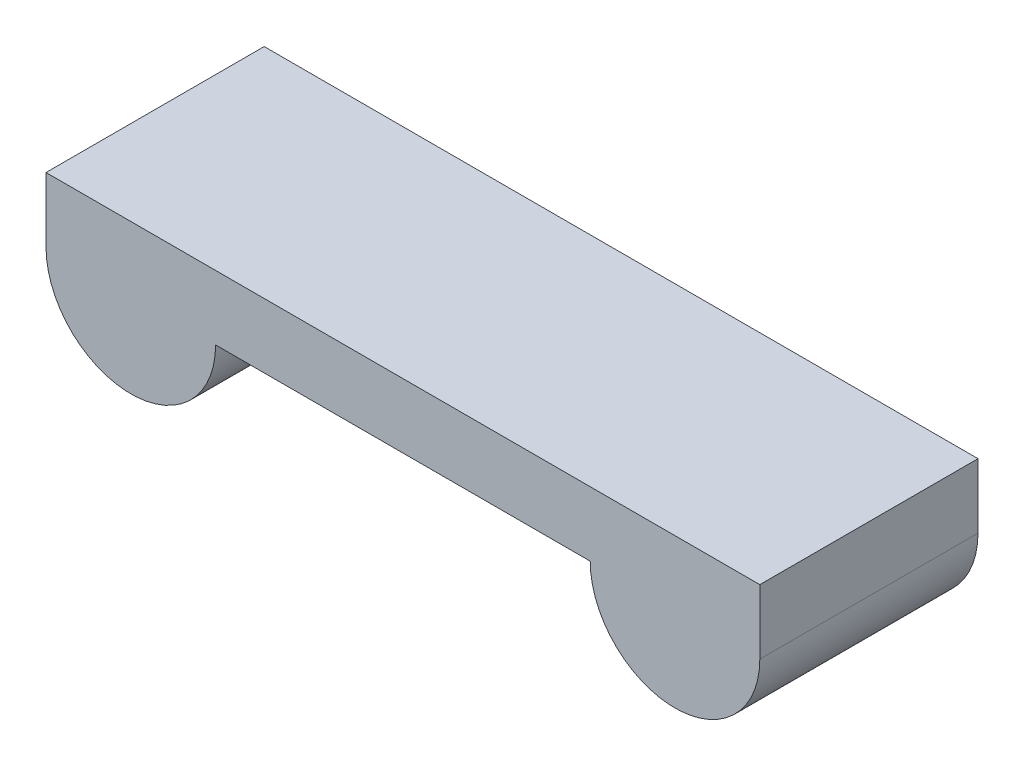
from build123d import *

# Parameters (mm, degrees)
LINEAR_AUSTRAGEN1_DEPTH = 15


with BuildPart() as part:
    # Skizze1 → Linear austragen1 (new, symmetric)
    with BuildSketch(Plane.XY):
        with BuildLine():
            Line((-49.077217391, 0), (49.077217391, 0))
            Line((49.077217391, 0), (49.077217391, -8.867913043))
            ThreePointArc((49.077217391, -8.867913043), (37.415304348, -20.529826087), (25.753391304, -8.867913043))
            Line((25.753391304, -8.867913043), (-25.753391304, -8.867913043))
            ThreePointArc((-25.753391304, -8.867913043), (-37.415304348, -20.529826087), (-49.077217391, -8.867913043))
            Line((-49.077217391, -8.867913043), (-49.077217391, 0))
        make_face()
    extrude(amount=LINEAR_AUSTRAGEN1_DEPTH, both=True)


solid = part.part
